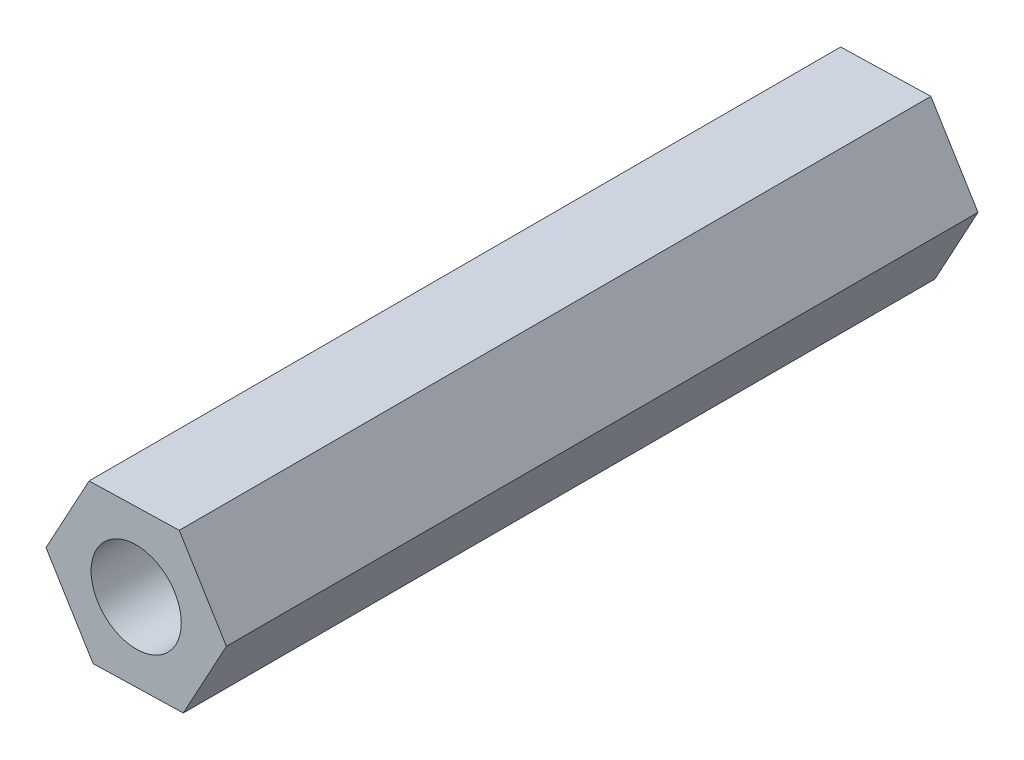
from build123d import *

# Parameters (mm, degrees)
ESQUISSE1_R        = 1.5
BOSS_EXTRU_1_DEPTH = 25


with BuildPart() as part:
    # Esquisse1 → Boss.-Extru.1 (new body)
    with BuildSketch(Plane.XY):
        Polygon((1.567545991, -2.559078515), (3, 0.077995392), (1.432454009, 2.637073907), (-1.567545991, 2.559078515), (-3, -0.077995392), (-1.432454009, -2.637073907), align=None)
        Circle(ESQUISSE1_R, mode=Mode.SUBTRACT)
    extrude(amount=BOSS_EXTRU_1_DEPTH)


solid = part.part
